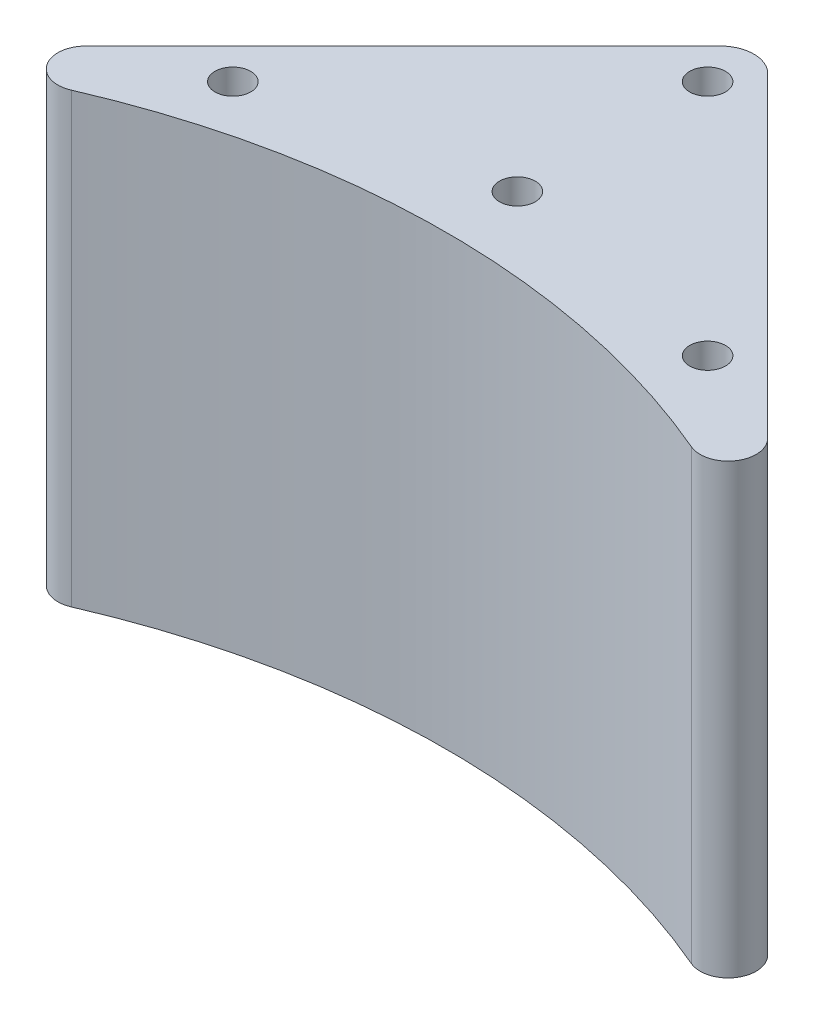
from build123d import *

# Parameters (mm, degrees)
SKETCH_1_R      = 1.6
EXTRUDE_1_DEPTH = 40
FILLET_1_R      = 3


with BuildPart() as part:
    # Sketch 1 → Extrude 1 (new body)
    with BuildSketch(Plane(origin=(0, 0, 0), x_dir=(1, 0, 0), z_dir=(0, 1, 0))):
        with BuildLine():
            Line((-30.539069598, -37.751558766), (-0.070710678, -7.283199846))
            Line((-0.070710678, -7.283199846), (30.290901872, -37.644812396))
            ThreePointArc((30.290901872, -37.644812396), (30.593681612, -40.813591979), (27.539578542, -41.710973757))
            ThreePointArc((27.539578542, -41.710973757), (-0.130418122, -36.06613867), (-27.779188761, -41.814039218))
            ThreePointArc((-27.779188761, -41.814039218), (-30.839235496, -40.924193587), (-30.539069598, -37.751558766))
        make_face()
        with Locations(Location((-21.213203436, -33.941125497, 0), (0, 0, 270))):
            Circle(SKETCH_1_R, mode=Mode.SUBTRACT)
        with Locations(Location((21.213203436, -33.941125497, 0), (0, 0, 270))):
            Circle(SKETCH_1_R, mode=Mode.SUBTRACT)
        with Locations(Location((0, -12.727922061, 0), (0, 0, 270))):
            Circle(SKETCH_1_R, mode=Mode.SUBTRACT)
        with Locations(Location((0, -29.727922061, 0), (0, 0, 270))):
            Circle(SKETCH_1_R, mode=Mode.SUBTRACT)
    extrude(amount=EXTRUDE_1_DEPTH)

    # Fillet 1
    fillet_1_edges = [part.edges().sort_by_distance(p)[0] for p in [
        (-0.070710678, 20, 7.283199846),
    ]]
    fillet(fillet_1_edges, radius=FILLET_1_R)


solid = part.part
